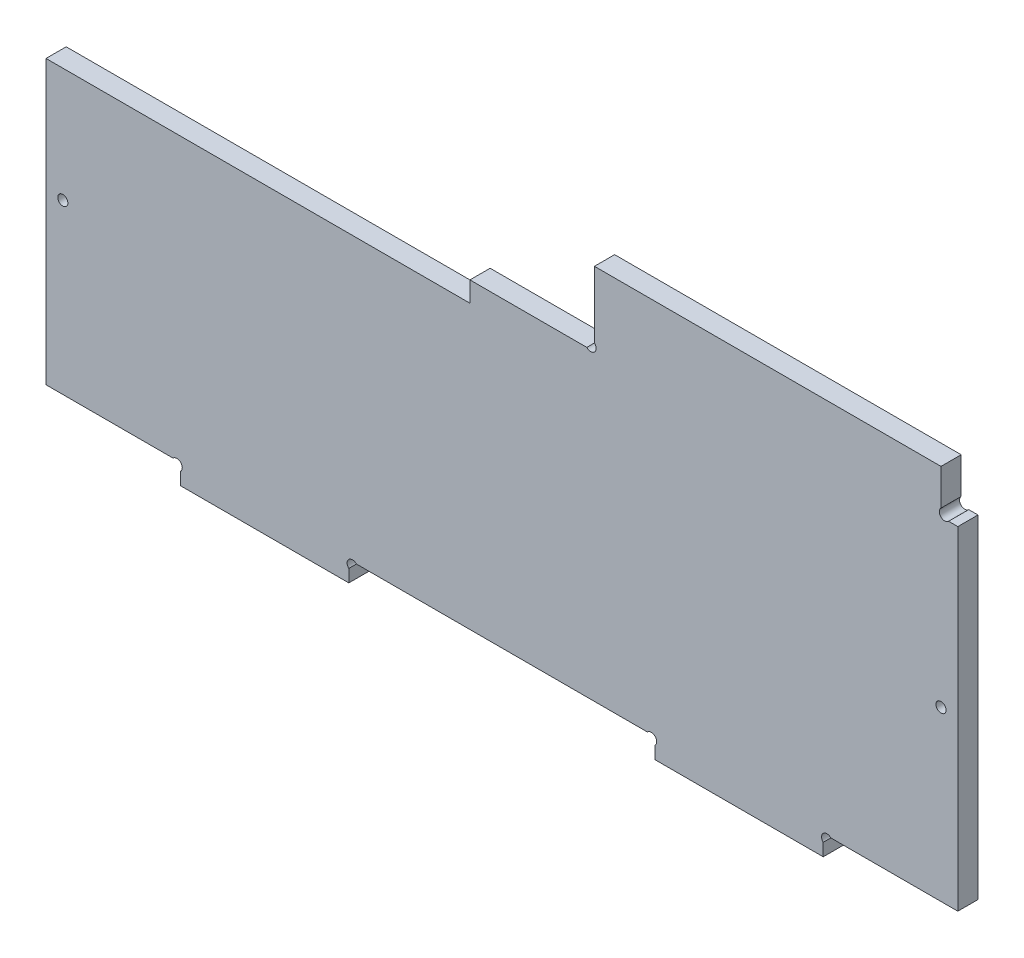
from build123d import *

# Parameters (mm, degrees)
EXTRUSION1_DEPTH        = 6
ESQUISSE2_W             = 40
ESQUISSE2_H             = 6
ESQUISSE2_W_2           = 91
ENL_V_MAT_EXTRU_1_DEPTH = 6
ESQUISSE3_R             = 1.6
ENL_V_MAT_EXTRU_2_DEPTH = 6
ESQUISSE4_R             = 1.5
ENL_V_MAT_EXTRU_3_DEPTH = 6


with BuildPart() as part:
    # Esquisse1 → Extrusion1 (new body)
    with BuildSketch(Plane.XY):
        Polygon((271, 105), (266, 105), (266, 118), (163, 118), (163, 96), (126, 96), (126, 90), (0, 90), (0, 0), (271, 0), align=None)
    extrude(amount=EXTRUSION1_DEPTH)

    # Esquisse2 → Enl_v. mat.-Extru.1 (cut)
    with BuildSketch(Plane.XY.offset(6)):
        with Locations((251, 3)):
            Rectangle(ESQUISSE2_W, ESQUISSE2_H)
        with Locations((20, 3)):
            Rectangle(ESQUISSE2_W, ESQUISSE2_H)
        with Locations((135.5, 3)):
            Rectangle(ESQUISSE2_W_2, ESQUISSE2_H)
    extrude(amount=-ENL_V_MAT_EXTRU_1_DEPTH, mode=Mode.SUBTRACT)

    # Esquisse3 → Enl_v. mat.-Extru.2 (cut)
    with BuildSketch(Plane.XY.offset(6)):
        with Locations((38.9, 4.9)):
            Circle(ESQUISSE3_R)
        with Locations((91.1, 4.9)):
            Circle(ESQUISSE3_R)
        with Locations((179.9, 4.9)):
            Circle(ESQUISSE3_R)
        with Locations((232.1, 4.9)):
            Circle(ESQUISSE3_R)
        with Locations((267.1, 106.1)):
            Circle(ESQUISSE3_R)
        with Locations((161.9, 97.1)):
            Circle(ESQUISSE3_R)
    extrude(amount=-ENL_V_MAT_EXTRU_2_DEPTH, mode=Mode.SUBTRACT)

    # Esquisse4 → Enl_v. mat.-Extru.3 (cut)
    with BuildSketch(Plane.XY.offset(6)):
        with Locations((266, 56)):
            Circle(ESQUISSE4_R)
        with Locations((5, 56)):
            Circle(ESQUISSE4_R)
    extrude(amount=-ENL_V_MAT_EXTRU_3_DEPTH, mode=Mode.SUBTRACT)


solid = part.part
